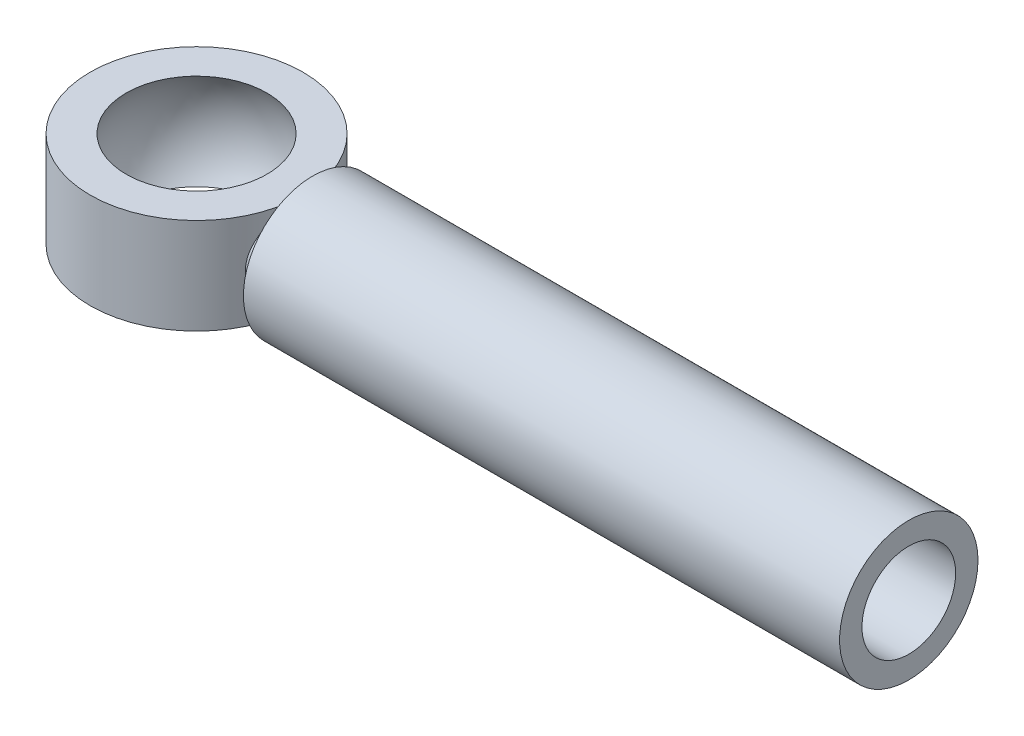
ISO-10303-21;
HEADER;
FILE_DESCRIPTION(('STEP AP214'),'2;1');
FILE_NAME('part.step','',(''),(''),'','','');
FILE_SCHEMA(('AUTOMOTIVE_DESIGN { 1 0 10303 214 1 1 1 1 }'));
ENDSEC;
DATA;
#1=APPLICATION_CONTEXT('core data for automotive mechanical design processes');
#2=APPLICATION_PROTOCOL_DEFINITION('international standard','automotive_design',2000,#1);
#3=PRODUCT_CONTEXT('',#1,'mechanical');
#4=PRODUCT('Part','Part','',(#3));
#5=PRODUCT_RELATED_PRODUCT_CATEGORY('part','',(#4));
#6=PRODUCT_DEFINITION_FORMATION('','',#4);
#7=PRODUCT_DEFINITION_CONTEXT('part definition',#1,'design');
#8=PRODUCT_DEFINITION('design','',#6,#7);
#9=PRODUCT_DEFINITION_SHAPE('','',#8);
#10=(LENGTH_UNIT() NAMED_UNIT(*) SI_UNIT(.MILLI.,.METRE.));
#11=(NAMED_UNIT(*) PLANE_ANGLE_UNIT() SI_UNIT($,.RADIAN.));
#12=(NAMED_UNIT(*) SI_UNIT($,.STERADIAN.) SOLID_ANGLE_UNIT());
#13=UNCERTAINTY_MEASURE_WITH_UNIT(LENGTH_MEASURE(1.E-05),#10,'distance_accuracy_value','');
#14=(GEOMETRIC_REPRESENTATION_CONTEXT(3) GLOBAL_UNCERTAINTY_ASSIGNED_CONTEXT((#13)) GLOBAL_UNIT_ASSIGNED_CONTEXT((#10,
#11,#12)) REPRESENTATION_CONTEXT('',''));
#15=CARTESIAN_POINT('',(0.,0.,0.));
#16=DIRECTION('',(0.,0.,1.));
#17=DIRECTION('',(1.,0.,0.));
#18=AXIS2_PLACEMENT_3D('',#15,#16,#17);
#19=CARTESIAN_POINT('',(-130.,0.,0.));
#20=DIRECTION('',(1.,0.,0.));
#21=DIRECTION('',(0.,0.,-1.));
#22=AXIS2_PLACEMENT_3D('',#19,#20,#21);
#23=PLANE('',#22);
#24=CARTESIAN_POINT('',(-130.,0.,0.));
#25=DIRECTION('',(1.,0.,0.));
#26=DIRECTION('',(0.,0.,-1.));
#27=AXIS2_PLACEMENT_3D('',#24,#25,#26);
#28=CIRCLE('',#27,32.5);
#29=CARTESIAN_POINT('',(-130.,0.,-32.5));
#30=VERTEX_POINT('',#29);
#31=EDGE_CURVE('E12',#30,#30,#28,.T.);
#32=ORIENTED_EDGE('',*,*,#31,.T.);
#33=EDGE_LOOP('',(#32));
#34=FACE_BOUND('',#33,.T.);
#35=CARTESIAN_POINT('',(-130.,0.,0.));
#36=DIRECTION('',(1.,0.,0.));
#37=DIRECTION('',(0.,0.,-1.));
#38=AXIS2_PLACEMENT_3D('',#35,#36,#37);
#39=CIRCLE('',#38,22.);
#40=CARTESIAN_POINT('',(-130.,0.,-22.));
#41=VERTEX_POINT('',#40);
#42=EDGE_CURVE('E53',#41,#41,#39,.T.);
#43=ORIENTED_EDGE('',*,*,#42,.F.);
#44=EDGE_LOOP('',(#43));
#45=FACE_BOUND('',#44,.T.);
#46=ADVANCED_FACE('F46',(#34,#45),#23,.T.);
#47=CARTESIAN_POINT('',(-130.,0.,0.));
#48=DIRECTION('',(-1.,0.,0.));
#49=DIRECTION('',(0.,0.,1.));
#50=AXIS2_PLACEMENT_3D('',#47,#48,#49);
#51=CYLINDRICAL_SURFACE('',#50,32.5);
#52=ORIENTED_EDGE('',*,*,#31,.F.);
#53=EDGE_LOOP('',(#52));
#54=FACE_BOUND('',#53,.T.);
#55=CARTESIAN_POINT('',(-410.,0.,0.));
#56=DIRECTION('',(1.,0.,0.));
#57=DIRECTION('',(0.,0.,-1.));
#58=AXIS2_PLACEMENT_3D('',#55,#56,#57);
#59=CIRCLE('',#58,32.5);
#60=CARTESIAN_POINT('',(-410.,0.,-32.5));
#61=VERTEX_POINT('',#60);
#62=EDGE_CURVE('E57',#61,#61,#59,.T.);
#63=ORIENTED_EDGE('',*,*,#62,.T.);
#64=EDGE_LOOP('',(#63));
#65=FACE_BOUND('',#64,.T.);
#66=ADVANCED_FACE('F48',(#54,#65),#51,.T.);
#67=CARTESIAN_POINT('',(-130.,0.,0.));
#68=DIRECTION('',(-1.,0.,0.));
#69=DIRECTION('',(0.,0.,1.));
#70=AXIS2_PLACEMENT_3D('',#67,#68,#69);
#71=CYLINDRICAL_SURFACE('',#70,22.);
#72=ORIENTED_EDGE('',*,*,#42,.T.);
#73=EDGE_LOOP('',(#72));
#74=FACE_BOUND('',#73,.T.);
#75=CARTESIAN_POINT('',(-410.,0.,0.));
#76=DIRECTION('',(1.,0.,0.));
#77=DIRECTION('',(0.,0.,-1.));
#78=AXIS2_PLACEMENT_3D('',#75,#76,#77);
#79=CIRCLE('',#78,22.);
#80=CARTESIAN_POINT('',(-410.,0.,-22.));
#81=VERTEX_POINT('',#80);
#82=EDGE_CURVE('E61',#81,#81,#79,.T.);
#83=ORIENTED_EDGE('',*,*,#82,.F.);
#84=EDGE_LOOP('',(#83));
#85=FACE_BOUND('',#84,.T.);
#86=ADVANCED_FACE('F70',(#74,#85),#71,.F.);
#87=CARTESIAN_POINT('',(-410.,0.,0.));
#88=DIRECTION('',(1.,0.,0.));
#89=DIRECTION('',(0.,0.,-1.));
#90=AXIS2_PLACEMENT_3D('',#87,#88,#89);
#91=PLANE('',#90);
#92=ORIENTED_EDGE('',*,*,#82,.T.);
#93=EDGE_LOOP('',(#92));
#94=FACE_BOUND('',#93,.T.);
#95=ORIENTED_EDGE('',*,*,#62,.F.);
#96=EDGE_LOOP('',(#95));
#97=FACE_BOUND('',#96,.T.);
#98=ADVANCED_FACE('F67',(#94,#97),#91,.F.);
#99=CLOSED_SHELL('',(#46,#66,#86,#98));
#100=MANIFOLD_SOLID_BREP('B2',#99);
#101=CARTESIAN_POINT('',(-464.5,-22.5,0.));
#102=DIRECTION('',(0.,-1.,0.));
#103=DIRECTION('',(0.,0.,-1.));
#104=AXIS2_PLACEMENT_3D('',#101,#102,#103);
#105=CYLINDRICAL_SURFACE('',#104,50.);
#106=CARTESIAN_POINT('',(-464.5,-22.5,0.));
#107=DIRECTION('',(0.,-1.,0.));
#108=DIRECTION('',(0.,0.,-1.));
#109=AXIS2_PLACEMENT_3D('',#106,#107,#108);
#110=CIRCLE('',#109,50.);
#111=CARTESIAN_POINT('',(-464.5,-22.5,-50.));
#112=VERTEX_POINT('',#111);
#113=EDGE_CURVE('E131',#112,#112,#110,.T.);
#114=ORIENTED_EDGE('',*,*,#113,.F.);
#115=EDGE_LOOP('',(#114));
#116=FACE_BOUND('',#115,.T.);
#117=CARTESIAN_POINT('',(-464.5,22.5,0.));
#118=DIRECTION('',(0.,-1.,0.));
#119=DIRECTION('',(0.,0.,-1.));
#120=AXIS2_PLACEMENT_3D('',#117,#118,#119);
#121=CIRCLE('',#120,50.);
#122=CARTESIAN_POINT('',(-464.5,22.5,-50.));
#123=VERTEX_POINT('',#122);
#124=EDGE_CURVE('E136',#123,#123,#121,.T.);
#125=ORIENTED_EDGE('',*,*,#124,.T.);
#126=EDGE_LOOP('',(#125));
#127=FACE_BOUND('',#126,.T.);
#128=CARTESIAN_POINT('',(-419.600111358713,0.,-22.));
#129=CARTESIAN_POINT('',(-419.600103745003,0.36821249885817,-21.9999835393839));
#130=CARTESIAN_POINT('',(-419.595464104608,0.736402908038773,-21.9906181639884));
#131=CARTESIAN_POINT('',(-419.577236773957,1.47086978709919,-21.9535091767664));
#132=CARTESIAN_POINT('',(-419.563667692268,1.83714864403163,-21.9258037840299));
#133=CARTESIAN_POINT('',(-419.527962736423,2.56607773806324,-21.8524711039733));
#134=CARTESIAN_POINT('',(-419.50585952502,2.92873646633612,-21.806912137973));
#135=CARTESIAN_POINT('',(-419.453408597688,3.64870124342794,-21.6982075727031));
#136=CARTESIAN_POINT('',(-419.423108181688,4.0060259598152,-21.6351628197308));
#137=CARTESIAN_POINT('',(-419.354647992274,4.71482595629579,-21.4919367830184));
#138=CARTESIAN_POINT('',(-419.316522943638,5.06631990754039,-21.4118311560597));
#139=CARTESIAN_POINT('',(-419.23294879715,5.76418120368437,-21.2347100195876));
#140=CARTESIAN_POINT('',(-419.187498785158,6.11054790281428,-21.137692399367));
#141=CARTESIAN_POINT('',(-419.089669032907,6.79819116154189,-20.9266974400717));
#142=CARTESIAN_POINT('',(-419.037269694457,7.13945016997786,-20.8126720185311));
#143=CARTESIAN_POINT('',(-418.925971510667,7.8169339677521,-20.5676832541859));
#144=CARTESIAN_POINT('',(-418.867038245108,8.15312036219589,-20.436629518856));
#145=CARTESIAN_POINT('',(-418.743492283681,8.81847745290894,-20.1585040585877));
#146=CARTESIAN_POINT('',(-418.678869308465,9.14763405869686,-20.0114032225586));
#147=CARTESIAN_POINT('',(-418.54495097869,9.79666794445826,-19.7021554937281));
#148=CARTESIAN_POINT('',(-418.47566907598,10.1165684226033,-19.5400514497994));
#149=CARTESIAN_POINT('',(-418.33312149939,10.746807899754,-19.2010801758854));
#150=CARTESIAN_POINT('',(-418.259862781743,11.0571621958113,-19.0242384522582));
#151=CARTESIAN_POINT('',(-418.110054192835,11.668037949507,-18.6560894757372));
#152=CARTESIAN_POINT('',(-418.033506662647,11.9685661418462,-18.4647924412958));
#153=CARTESIAN_POINT('',(-417.877809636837,12.5595160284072,-18.0680235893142));
#154=CARTESIAN_POINT('',(-417.798659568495,12.8499354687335,-17.8625486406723));
#155=CARTESIAN_POINT('',(-417.638445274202,13.420395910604,-17.4377148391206));
#156=CARTESIAN_POINT('',(-417.557379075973,13.7004253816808,-17.2183412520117));
#157=CARTESIAN_POINT('',(-417.394019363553,14.2498314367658,-16.7659956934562));
#158=CARTESIAN_POINT('',(-417.311723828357,14.5191870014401,-16.5329989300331));
#159=CARTESIAN_POINT('',(-417.146588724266,15.0469804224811,-16.0537033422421));
#160=CARTESIAN_POINT('',(-417.063748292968,15.3053876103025,-15.8073710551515));
#161=CARTESIAN_POINT('',(-416.898590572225,15.8098342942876,-15.3028036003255));
#162=CARTESIAN_POINT('',(-416.816272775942,16.0558882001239,-15.0445830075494));
#163=CARTESIAN_POINT('',(-416.65309878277,16.5343287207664,-14.5173230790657));
#164=CARTESIAN_POINT('',(-416.572238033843,16.76676639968,-14.2483315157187));
#165=CARTESIAN_POINT('',(-416.412489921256,17.2180845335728,-13.6994880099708));
#166=CARTESIAN_POINT('',(-416.333599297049,17.4369884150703,-13.4196562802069));
#167=CARTESIAN_POINT('',(-416.178279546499,17.8614330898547,-12.8491451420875));
#168=CARTESIAN_POINT('',(-416.101851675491,18.0669671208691,-12.5584603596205));
#169=CARTESIAN_POINT('',(-415.951944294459,18.4647515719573,-11.965680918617));
#170=CARTESIAN_POINT('',(-415.878477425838,18.6569471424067,-11.6635462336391));
#171=CARTESIAN_POINT('',(-415.735155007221,19.0273619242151,-11.0485368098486));
#172=CARTESIAN_POINT('',(-415.66531259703,19.2055313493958,-10.7356290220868));
#173=CARTESIAN_POINT('',(-415.530083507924,19.5468398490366,-10.1008179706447));
#174=CARTESIAN_POINT('',(-415.464696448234,19.7099802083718,-9.77891547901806));
#175=CARTESIAN_POINT('',(-415.339187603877,20.0201228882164,-9.12782437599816));
#176=CARTESIAN_POINT('',(-415.279048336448,20.1671792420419,-8.79866492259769));
#177=CARTESIAN_POINT('',(-415.164804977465,20.4445682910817,-8.13313853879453));
#178=CARTESIAN_POINT('',(-415.11068895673,20.5749341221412,-7.7967874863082));
#179=CARTESIAN_POINT('',(-415.008718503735,20.8191808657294,-7.11674244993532));
#180=CARTESIAN_POINT('',(-414.960871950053,20.9330410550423,-6.77303984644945));
#181=CARTESIAN_POINT('',(-414.87170205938,21.1440085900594,-6.07946263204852));
#182=CARTESIAN_POINT('',(-414.830382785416,21.2411055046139,-5.72958432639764));
#183=CARTESIAN_POINT('',(-414.754591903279,21.4182360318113,-5.02480456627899));
#184=CARTESIAN_POINT('',(-414.720120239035,21.4982697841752,-4.66990315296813));
#185=CARTESIAN_POINT('',(-414.658331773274,21.6409749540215,-3.9562334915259));
#186=CARTESIAN_POINT('',(-414.63101063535,21.7036568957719,-3.59746772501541));
#187=CARTESIAN_POINT('',(-414.583838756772,21.8113542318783,-2.87722491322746));
#188=CARTESIAN_POINT('',(-414.563979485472,21.8563898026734,-2.51575144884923));
#189=CARTESIAN_POINT('',(-414.532031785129,21.9285004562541,-1.79125193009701));
#190=CARTESIAN_POINT('',(-414.519931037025,21.9556040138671,-1.42822926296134));
#191=CARTESIAN_POINT('',(-414.503852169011,21.9915252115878,-0.701785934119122));
#192=CARTESIAN_POINT('',(-414.499858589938,22.0003776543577,-0.338367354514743));
#193=CARTESIAN_POINT('',(-414.500154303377,21.999592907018,0.389317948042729));
#194=CARTESIAN_POINT('',(-414.504463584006,21.9899110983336,0.753584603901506));
#195=CARTESIAN_POINT('',(-414.52096819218,21.952496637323,1.48268950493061));
#196=CARTESIAN_POINT('',(-414.533199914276,21.9246806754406,1.84752259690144));
#197=CARTESIAN_POINT('',(-414.565416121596,21.8511506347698,2.57549285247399));
#198=CARTESIAN_POINT('',(-414.585410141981,21.8054145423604,2.9386273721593));
#199=CARTESIAN_POINT('',(-414.63301934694,21.6961077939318,3.66089675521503));
#200=CARTESIAN_POINT('',(-414.660617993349,21.6325758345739,4.02003855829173));
#201=CARTESIAN_POINT('',(-414.723138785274,21.4881374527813,4.73233559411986));
#202=CARTESIAN_POINT('',(-414.758024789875,21.4073167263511,5.08551140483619));
#203=CARTESIAN_POINT('',(-414.834588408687,21.2289066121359,5.78554223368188));
#204=CARTESIAN_POINT('',(-414.876242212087,21.1313759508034,6.13241483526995));
#205=CARTESIAN_POINT('',(-414.966044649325,20.9196150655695,6.81990252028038));
#206=CARTESIAN_POINT('',(-415.014188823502,20.8053963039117,7.16052171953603));
#207=CARTESIAN_POINT('',(-415.116590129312,20.5605540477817,7.83565111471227));
#208=CARTESIAN_POINT('',(-415.170859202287,20.4298984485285,8.17014784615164));
#209=CARTESIAN_POINT('',(-415.285311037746,20.1519494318,8.8331927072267));
#210=CARTESIAN_POINT('',(-415.345522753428,20.0045739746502,9.16170144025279));
#211=CARTESIAN_POINT('',(-415.471232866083,19.6936842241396,9.81160513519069));
#212=CARTESIAN_POINT('',(-415.536751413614,19.5301078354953,10.1329664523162));
#213=CARTESIAN_POINT('',(-415.672188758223,19.188027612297,10.7666951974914));
#214=CARTESIAN_POINT('',(-415.742107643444,19.0095234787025,11.0790624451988));
#215=CARTESIAN_POINT('',(-415.885514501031,18.6385935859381,11.6927911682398));
#216=CARTESIAN_POINT('',(-415.958986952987,18.44622683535,11.9941919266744));
#217=CARTESIAN_POINT('',(-416.108835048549,18.0482539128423,12.5853289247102));
#218=CARTESIAN_POINT('',(-416.185196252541,17.8427107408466,12.8751112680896));
#219=CARTESIAN_POINT('',(-416.340339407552,17.4183568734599,13.443804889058));
#220=CARTESIAN_POINT('',(-416.419119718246,17.1995550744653,13.7227232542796));
#221=CARTESIAN_POINT('',(-416.578606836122,16.7485432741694,14.269719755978));
#222=CARTESIAN_POINT('',(-416.659316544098,16.5163122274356,14.537779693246));
#223=CARTESIAN_POINT('',(-416.822151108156,16.0384241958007,15.0631899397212));
#224=CARTESIAN_POINT('',(-416.904280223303,15.7927188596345,15.3204949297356));
#225=CARTESIAN_POINT('',(-417.069131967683,15.2886644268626,15.8234869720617));
#226=CARTESIAN_POINT('',(-417.151855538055,15.0302869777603,16.0691453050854));
#227=CARTESIAN_POINT('',(-417.316899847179,14.501972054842,16.5475300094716));
#228=CARTESIAN_POINT('',(-417.399220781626,14.2320409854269,16.7802633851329));
#229=CARTESIAN_POINT('',(-417.56272581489,13.6811163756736,17.2324055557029));
#230=CARTESIAN_POINT('',(-417.643910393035,13.4001277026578,17.4518201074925));
#231=CARTESIAN_POINT('',(-417.804404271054,12.8275589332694,17.8769072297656));
#232=CARTESIAN_POINT('',(-417.883714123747,12.5359820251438,18.0825838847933));
#233=CARTESIAN_POINT('',(-418.039721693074,11.9427153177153,18.4797854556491));
#234=CARTESIAN_POINT('',(-418.116419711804,11.6410266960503,18.6713120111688));
#235=CARTESIAN_POINT('',(-418.266466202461,11.0280125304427,19.0398004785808));
#236=CARTESIAN_POINT('',(-418.339814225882,10.7166857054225,19.2167604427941));
#237=CARTESIAN_POINT('',(-418.482426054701,10.0848757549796,19.5557124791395));
#238=CARTESIAN_POINT('',(-418.551687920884,9.76438838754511,19.7176974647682));
#239=CARTESIAN_POINT('',(-418.685385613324,9.11472445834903,20.0262677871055));
#240=CARTESIAN_POINT('',(-418.749816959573,8.78554020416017,20.1728388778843));
#241=CARTESIAN_POINT('',(-418.872931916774,8.12013993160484,20.4497899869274));
#242=CARTESIAN_POINT('',(-418.931626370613,7.78393869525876,20.5802006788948));
#243=CARTESIAN_POINT('',(-419.042559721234,7.10576527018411,20.8242015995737));
#244=CARTESIAN_POINT('',(-419.094820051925,6.76381680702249,20.9378479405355));
#245=CARTESIAN_POINT('',(-419.192426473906,6.07407134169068,21.1482337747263));
#246=CARTESIAN_POINT('',(-419.237777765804,5.72627895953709,21.2449859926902));
#247=CARTESIAN_POINT('',(-419.321182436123,5.02480870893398,21.4216535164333));
#248=CARTESIAN_POINT('',(-419.359220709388,4.67112026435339,21.5015340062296));
#249=CARTESIAN_POINT('',(-419.427346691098,3.95809714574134,21.6439939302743));
#250=CARTESIAN_POINT('',(-419.457403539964,3.59874608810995,21.7065062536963));
#251=CARTESIAN_POINT('',(-419.509161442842,2.87624488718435,21.8137335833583));
#252=CARTESIAN_POINT('',(-419.530849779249,2.51308981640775,21.8584215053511));
#253=CARTESIAN_POINT('',(-419.565628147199,1.78525376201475,21.9298394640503));
#254=CARTESIAN_POINT('',(-419.57873317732,1.42057656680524,21.9566008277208));
#255=CARTESIAN_POINT('',(-419.596118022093,0.691945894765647,21.9919368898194));
#256=CARTESIAN_POINT('',(-419.600441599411,0.327997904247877,22.0006017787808));
#257=CARTESIAN_POINT('',(-419.59975320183,-0.398975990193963,21.9993410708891));
#258=CARTESIAN_POINT('',(-419.594763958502,-0.762001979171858,21.98946074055));
#259=CARTESIAN_POINT('',(-419.575760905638,-1.48760574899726,21.9514754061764));
#260=CARTESIAN_POINT('',(-419.561728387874,-1.85018103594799,21.9233326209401));
#261=CARTESIAN_POINT('',(-419.525156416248,-2.57365096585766,21.8492140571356));
#262=CARTESIAN_POINT('',(-419.502603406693,-2.93454199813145,21.8032098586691));
#263=CARTESIAN_POINT('',(-419.44942654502,-3.65340233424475,21.6937012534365));
#264=CARTESIAN_POINT('',(-419.418795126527,-4.01136857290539,21.6301804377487));
#265=CARTESIAN_POINT('',(-419.349919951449,-4.72313911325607,21.4859851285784));
#266=CARTESIAN_POINT('',(-419.31167509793,-5.0769428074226,21.4053081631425));
#267=CARTESIAN_POINT('',(-419.228018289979,-5.77914194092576,21.2271350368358));
#268=CARTESIAN_POINT('',(-419.182611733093,-6.12754123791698,21.1296515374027));
#269=CARTESIAN_POINT('',(-419.085104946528,-6.81769645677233,20.9182228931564));
#270=CARTESIAN_POINT('',(-419.033016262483,-7.15946269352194,20.8043061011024));
#271=CARTESIAN_POINT('',(-418.922519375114,-7.83506542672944,20.5602810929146));
#272=CARTESIAN_POINT('',(-418.864128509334,-8.16892074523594,20.4302171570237));
#273=CARTESIAN_POINT('',(-418.741474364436,-8.82919214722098,20.1538211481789));
#274=CARTESIAN_POINT('',(-418.677204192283,-9.15559892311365,20.0074699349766));
#275=CARTESIAN_POINT('',(-418.543663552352,-9.80157363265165,19.6988628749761));
#276=CARTESIAN_POINT('',(-418.474372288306,-10.1211050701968,19.5365397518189));
#277=CARTESIAN_POINT('',(-418.331561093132,-10.751979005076,19.1966009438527));
#278=CARTESIAN_POINT('',(-418.258031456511,-11.0633001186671,19.0189496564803));
#279=CARTESIAN_POINT('',(-418.107594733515,-11.676402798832,18.6489838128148));
#280=CARTESIAN_POINT('',(-418.030686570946,-11.9781812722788,18.45666456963));
#281=CARTESIAN_POINT('',(-417.874495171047,-12.5706511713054,18.0584667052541));
#282=CARTESIAN_POINT('',(-417.795219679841,-12.8613729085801,17.8526301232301));
#283=CARTESIAN_POINT('',(-417.635127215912,-13.4312157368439,17.4280846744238));
#284=CARTESIAN_POINT('',(-417.554316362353,-13.7103727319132,17.2094216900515));
#285=CARTESIAN_POINT('',(-417.39171001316,-14.2572125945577,16.7591768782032));
#286=CARTESIAN_POINT('',(-417.309915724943,-14.5249079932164,16.5276098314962));
#287=CARTESIAN_POINT('',(-417.145911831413,-15.0490779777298,16.0516509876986));
#288=CARTESIAN_POINT('',(-417.063701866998,-15.3055398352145,15.8072452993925));
#289=CARTESIAN_POINT('',(-416.899374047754,-15.8074306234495,15.3051806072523));
#290=CARTESIAN_POINT('',(-416.817257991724,-16.0528093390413,15.0474708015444));
#291=CARTESIAN_POINT('',(-416.653876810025,-16.5317660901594,14.519342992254));
#292=CARTESIAN_POINT('',(-416.572615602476,-16.7653004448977,14.2488841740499));
#293=CARTESIAN_POINT('',(-416.411905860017,-17.2193516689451,13.6967128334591));
#294=CARTESIAN_POINT('',(-416.332457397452,-17.4398680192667,13.4149998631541));
#295=CARTESIAN_POINT('',(-416.176362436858,-17.8665039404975,12.8416404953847));
#296=CARTESIAN_POINT('',(-416.099707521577,-18.0726688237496,12.550030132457));
#297=CARTESIAN_POINT('',(-415.949913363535,-18.4701280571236,11.9576008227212));
#298=CARTESIAN_POINT('',(-415.876762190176,-18.6614744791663,11.6568198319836));
#299=CARTESIAN_POINT('',(-415.734298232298,-19.0296646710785,11.0457545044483));
#300=CARTESIAN_POINT('',(-415.664984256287,-19.2065129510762,10.7354731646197));
#301=CARTESIAN_POINT('',(-415.530671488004,-19.5455060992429,10.1051776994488));
#302=CARTESIAN_POINT('',(-415.465682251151,-19.7076186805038,9.7851441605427));
#303=CARTESIAN_POINT('',(-415.340459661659,-20.0170613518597,9.13519118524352));
#304=CARTESIAN_POINT('',(-415.280250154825,-20.1643182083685,8.80523228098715));
#305=CARTESIAN_POINT('',(-415.165449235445,-20.4429492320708,8.13731265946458));
#306=CARTESIAN_POINT('',(-415.110863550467,-20.5743072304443,7.79934420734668));
#307=CARTESIAN_POINT('',(-415.008079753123,-20.8199377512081,7.11776141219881));
#308=CARTESIAN_POINT('',(-414.95985838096,-20.9342726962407,6.77417309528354));
#309=CARTESIAN_POINT('',(-414.870129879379,-21.1457354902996,6.08192285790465));
#310=CARTESIAN_POINT('',(-414.828604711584,-21.242909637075,5.73327742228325));
#311=CARTESIAN_POINT('',(-414.752568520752,-21.419993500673,5.03148989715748));
#312=CARTESIAN_POINT('',(-414.718045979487,-21.4999315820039,4.67835622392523));
#313=CARTESIAN_POINT('',(-414.656356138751,-21.6423881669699,3.96688706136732));
#314=CARTESIAN_POINT('',(-414.62921029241,-21.7048558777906,3.608539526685));
#315=CARTESIAN_POINT('',(-414.582425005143,-21.8122424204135,2.88719534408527));
#316=CARTESIAN_POINT('',(-414.562817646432,-21.857086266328,2.52418547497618));
#317=CARTESIAN_POINT('',(-414.531322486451,-21.9289494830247,1.79587774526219));
#318=CARTESIAN_POINT('',(-414.519438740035,-21.9559594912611,1.4305787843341));
#319=CARTESIAN_POINT('',(-414.503701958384,-21.9916561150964,0.700038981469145));
#320=CARTESIAN_POINT('',(-414.499824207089,-22.0003991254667,0.334801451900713));
#321=CARTESIAN_POINT('',(-414.500193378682,-21.9995609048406,-0.393821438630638));
#322=CARTESIAN_POINT('',(-414.504399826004,-21.9900709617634,-0.757206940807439));
#323=CARTESIAN_POINT('',(-414.520645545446,-21.9532167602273,-1.48193969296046));
#324=CARTESIAN_POINT('',(-414.532664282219,-21.9258993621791,-1.84328978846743));
#325=CARTESIAN_POINT('',(-414.564454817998,-21.8533532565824,-2.56395163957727));
#326=CARTESIAN_POINT('',(-414.584228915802,-21.8081192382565,-2.92326275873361));
#327=CARTESIAN_POINT('',(-414.631351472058,-21.6999421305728,-3.63987978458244));
#328=CARTESIAN_POINT('',(-414.658723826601,-21.6369431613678,-3.99717567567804));
#329=CARTESIAN_POINT('',(-414.72100333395,-21.4930783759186,-4.709213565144));
#330=CARTESIAN_POINT('',(-414.755944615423,-21.4121315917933,-5.06393621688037));
#331=CARTESIAN_POINT('',(-414.832905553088,-21.2327943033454,-5.76891430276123));
#332=CARTESIAN_POINT('',(-414.87493911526,-21.1343695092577,-6.11915947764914));
#333=CARTESIAN_POINT('',(-414.965458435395,-20.920938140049,-6.81316311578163));
#334=CARTESIAN_POINT('',(-415.013935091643,-20.8059549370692,-7.15692996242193));
#335=CARTESIAN_POINT('',(-415.116743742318,-20.5601497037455,-7.8359228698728));
#336=CARTESIAN_POINT('',(-415.171045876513,-20.4294080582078,-8.17118253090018));
#337=CARTESIAN_POINT('',(-415.285284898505,-20.1520500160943,-8.83308930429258));
#338=CARTESIAN_POINT('',(-415.345207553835,-20.0054735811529,-9.1597556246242));
#339=CARTESIAN_POINT('',(-415.470254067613,-19.6965471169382,-9.80539740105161));
#340=CARTESIAN_POINT('',(-415.53538879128,-19.5341639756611,-10.1243548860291));
#341=CARTESIAN_POINT('',(-415.670155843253,-19.1942207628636,-10.7538104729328));
#342=CARTESIAN_POINT('',(-415.739795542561,-19.0166356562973,-11.0642934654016));
#343=CARTESIAN_POINT('',(-415.882881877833,-18.6468894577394,-11.6760264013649));
#344=CARTESIAN_POINT('',(-415.956332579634,-18.4547126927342,-11.9772659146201));
#345=CARTESIAN_POINT('',(-416.106345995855,-18.0563818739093,-12.5697378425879));
#346=CARTESIAN_POINT('',(-416.182909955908,-17.8502222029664,-12.8609661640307));
#347=CARTESIAN_POINT('',(-416.338457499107,-17.4245217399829,-13.432636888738));
#348=CARTESIAN_POINT('',(-416.417440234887,-17.2049856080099,-13.7130829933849));
#349=CARTESIAN_POINT('',(-416.577123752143,-16.7531367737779,-14.2624195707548));
#350=CARTESIAN_POINT('',(-416.657822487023,-16.5208388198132,-14.5313227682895));
#351=CARTESIAN_POINT('',(-416.820265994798,-16.0440386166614,-15.0567631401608));
#352=CARTESIAN_POINT('',(-416.902008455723,-15.79956071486,-15.3133231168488));
#353=CARTESIAN_POINT('',(-417.06604697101,-15.2981962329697,-15.814309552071));
#354=CARTESIAN_POINT('',(-417.14834345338,-15.0412988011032,-16.0587250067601));
#355=CARTESIAN_POINT('',(-417.312849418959,-14.5151088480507,-16.535731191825));
#356=CARTESIAN_POINT('',(-417.395057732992,-14.2457784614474,-16.7682805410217));
#357=CARTESIAN_POINT('',(-417.558548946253,-13.6954912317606,-17.2206835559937));
#358=CARTESIAN_POINT('',(-417.639829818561,-13.4145135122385,-17.4405125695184));
#359=CARTESIAN_POINT('',(-417.800593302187,-12.8416953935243,-17.8665894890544));
#360=CARTESIAN_POINT('',(-417.880074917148,-12.5498492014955,-18.0728299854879));
#361=CARTESIAN_POINT('',(-418.036233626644,-11.9567542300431,-18.4706561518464));
#362=CARTESIAN_POINT('',(-418.112917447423,-11.655531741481,-18.6622783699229));
#363=CARTESIAN_POINT('',(-418.262681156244,-11.0445331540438,-19.0303689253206));
#364=CARTESIAN_POINT('',(-418.335772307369,-10.7347892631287,-19.2068861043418));
#365=CARTESIAN_POINT('',(-418.477783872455,-10.106607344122,-19.5447227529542));
#366=CARTESIAN_POINT('',(-418.546708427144,-9.78817841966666,-19.7060574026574));
#367=CARTESIAN_POINT('',(-418.679872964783,-9.14257558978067,-20.0136518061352));
#368=CARTESIAN_POINT('',(-418.744106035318,-8.81538971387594,-20.1598894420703));
#369=CARTESIAN_POINT('',(-418.867206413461,-8.15199624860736,-20.4370043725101));
#370=CARTESIAN_POINT('',(-418.926051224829,-7.81575780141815,-20.5678178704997));
#371=CARTESIAN_POINT('',(-419.037618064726,-7.13548642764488,-20.813339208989));
#372=CARTESIAN_POINT('',(-419.090324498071,-6.79143619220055,-20.9280061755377));
#373=CARTESIAN_POINT('',(-419.188890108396,-6.09763135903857,-21.1405691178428));
#374=CARTESIAN_POINT('',(-419.234756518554,-5.74788322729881,-21.2384828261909));
#375=CARTESIAN_POINT('',(-419.318820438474,-5.04469598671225,-21.4166470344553));
#376=CARTESIAN_POINT('',(-419.357051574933,-4.69128061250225,-21.4969751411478));
#377=CARTESIAN_POINT('',(-419.425330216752,-3.98158589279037,-21.6397998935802));
#378=CARTESIAN_POINT('',(-419.455410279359,-3.62532397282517,-21.7023675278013));
#379=CARTESIAN_POINT('',(-419.50735303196,-2.90936450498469,-21.8099951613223));
#380=CARTESIAN_POINT('',(-419.529211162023,-2.54966516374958,-21.8550454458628));
#381=CARTESIAN_POINT('',(-419.564412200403,-1.82675934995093,-21.927335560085));
#382=CARTESIAN_POINT('',(-419.577724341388,-1.46354493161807,-21.954511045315));
#383=CARTESIAN_POINT('',(-419.595613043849,-0.73355791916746,-21.9909218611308));
#384=CARTESIAN_POINT('',(-419.600130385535,-0.366777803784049,-22.0000355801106));
#385=CARTESIAN_POINT('',(-419.600111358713,0.,-22.));
#386=B_SPLINE_CURVE_WITH_KNOTS('',3,(#128,#129,#130,#131,#132,#133,#134,#135,#136,#137,#138,
#139,#140,#141,#142,#143,#144,#145,#146,#147,#148,#149,#150,#151,#152,#153,#154,#155,#156,#157,
#158,#159,#160,#161,#162,#163,#164,#165,#166,#167,#168,#169,#170,#171,#172,#173,#174,#175,#176,
#177,#178,#179,#180,#181,#182,#183,#184,#185,#186,#187,#188,#189,#190,#191,#192,#193,#194,#195,
#196,#197,#198,#199,#200,#201,#202,#203,#204,#205,#206,#207,#208,#209,#210,#211,#212,#213,#214,
#215,#216,#217,#218,#219,#220,#221,#222,#223,#224,#225,#226,#227,#228,#229,#230,#231,#232,#233,
#234,#235,#236,#237,#238,#239,#240,#241,#242,#243,#244,#245,#246,#247,#248,#249,#250,#251,#252,
#253,#254,#255,#256,#257,#258,#259,#260,#261,#262,#263,#264,#265,#266,#267,#268,#269,#270,#271,
#272,#273,#274,#275,#276,#277,#278,#279,#280,#281,#282,#283,#284,#285,#286,#287,#288,#289,#290,
#291,#292,#293,#294,#295,#296,#297,#298,#299,#300,#301,#302,#303,#304,#305,#306,#307,#308,#309,
#310,#311,#312,#313,#314,#315,#316,#317,#318,#319,#320,#321,#322,#323,#324,#325,#326,#327,#328,
#329,#330,#331,#332,#333,#334,#335,#336,#337,#338,#339,#340,#341,#342,#343,#344,#345,#346,#347,
#348,#349,#350,#351,#352,#353,#354,#355,#356,#357,#358,#359,#360,#361,#362,#363,#364,#365,#366,
#367,#368,#369,#370,#371,#372,#373,#374,#375,#376,#377,#378,#379,#380,#381,#382,#383,#384,#385),
.UNSPECIFIED.,.F.,.F.,(4,2,2,2,2,2,2,2,2,2,2,2,2,2,2,2,2,2,2,2,2,2,2,2,2,2,2,2,2,2,2,2,2,2,2,2,
2,2,2,2,2,2,2,2,2,2,2,2,2,2,2,2,2,2,2,2,2,2,2,2,2,2,2,2,2,2,2,2,2,2,2,2,2,2,2,2,2,2,2,2,2,2,2,2,
2,2,2,2,2,2,2,2,2,2,2,2,2,2,2,2,2,2,2,2,2,2,2,2,2,2,2,2,2,2,2,2,2,2,2,2,2,2,2,2,2,2,2,2,4),(0.,
1.10445792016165,2.20662145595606,3.30460782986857,4.39638891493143,5.48342569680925,
6.57059824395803,7.66090471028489,8.75725537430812,9.85562908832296,10.9509573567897,
12.0444278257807,13.1371324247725,14.2300791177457,15.3242045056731,16.4203870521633,
17.5194607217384,18.6172210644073,19.7105592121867,20.8019485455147,21.8938856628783,
22.9900752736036,24.0899951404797,25.1898208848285,26.2858303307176,27.3796289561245,
28.4747891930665,29.5706284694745,30.6664587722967,31.7616229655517,32.8555312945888,
33.9476983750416,35.0377808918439,36.1304909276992,37.2282566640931,38.3273751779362,
39.4241219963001,40.5155535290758,41.6032251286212,42.690153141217,43.7792381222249,
44.8739190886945,45.9729713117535,47.0720455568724,48.1666901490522,49.2564434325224,
50.3454734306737,51.4362589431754,52.531253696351,53.6288213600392,54.7257883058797,
55.8222776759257,56.9184395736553,58.0144742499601,59.1106552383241,60.207352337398,
61.3050542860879,62.4006397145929,63.4924705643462,64.5834754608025,65.6767101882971,
66.7741122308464,67.8731754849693,68.9703130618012,70.06196946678,71.1509647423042,
72.2422201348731,73.3352190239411,74.429245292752,75.5234293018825,76.6167925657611,
77.7082914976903,78.7968607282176,79.8867229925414,80.9813902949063,82.0786723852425,
83.1763065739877,84.2706754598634,85.3613436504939,86.4507872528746,87.54143492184,
88.6366097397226,89.7355667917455,90.8345676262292,91.9299243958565,93.0212387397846,
94.1122122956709,95.2055213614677,96.3039806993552,97.4035479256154,98.4989781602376,
99.5914063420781,100.682022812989,101.775777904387,102.874137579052,103.973073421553,
105.068611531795,106.15867884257,107.245892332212,108.333428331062,109.424424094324,
110.520445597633,111.618641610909,112.715302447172,113.806588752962,114.895182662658,
115.986108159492,117.078866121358,118.172814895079,119.267205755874,120.361217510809,
121.453990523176,122.544660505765,123.636301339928,124.731520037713,125.828794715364,
126.926662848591,128.021689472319,129.113029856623,130.203267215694,131.295079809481,
132.391260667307,133.490168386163,134.587905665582,135.680696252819,136.76905539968,
137.858017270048,138.950877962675,140.051072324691),.UNSPECIFIED.);
#387=CARTESIAN_POINT('',(-419.600111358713,0.,-22.));
#388=VERTEX_POINT('',#387);
#389=EDGE_CURVE('E45',#388,#388,#386,.T.);
#390=ORIENTED_EDGE('',*,*,#389,.F.);
#391=EDGE_LOOP('',(#390));
#392=FACE_BOUND('',#391,.T.);
#393=ADVANCED_FACE('F116',(#116,#127,#392),#105,.T.);
#394=CARTESIAN_POINT('',(-464.5,0.,0.));
#395=DIRECTION('',(0.,-1.,0.));
#396=DIRECTION('',(-1.,0.,0.));
#397=AXIS2_PLACEMENT_3D('',#394,#395,#396);
#398=SPHERICAL_SURFACE('',#397,40.0000000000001);
#399=CARTESIAN_POINT('',(-464.5,22.5,0.));
#400=DIRECTION('',(0.,-1.,0.));
#401=DIRECTION('',(0.,0.,-1.));
#402=AXIS2_PLACEMENT_3D('',#399,#400,#401);
#403=CIRCLE('',#402,33.0718913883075);
#404=CARTESIAN_POINT('',(-497.571891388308,22.5,0.));
#405=VERTEX_POINT('',#404);
#406=EDGE_CURVE('E171',#405,#405,#403,.T.);
#407=CARTESIAN_POINT('',(-464.5,-22.5,0.));
#408=DIRECTION('',(0.,-1.,0.));
#409=DIRECTION('',(0.,0.,-1.));
#410=AXIS2_PLACEMENT_3D('',#407,#408,#409);
#411=CIRCLE('',#410,33.0718913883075);
#412=CARTESIAN_POINT('',(-497.571891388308,-22.5,0.));
#413=VERTEX_POINT('',#412);
#414=EDGE_CURVE('E126',#413,#413,#411,.T.);
#415=CARTESIAN_POINT('',(-497.571891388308,22.5,0.));
#416=CARTESIAN_POINT('',(-497.851929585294,22.0883908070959,0.));
#417=CARTESIAN_POINT('',(-498.124275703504,21.671548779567,0.));
#418=CARTESIAN_POINT('',(-498.65322145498,20.827990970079,0.));
#419=CARTESIAN_POINT('',(-498.909821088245,20.4012751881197,0.));
#420=CARTESIAN_POINT('',(-499.406911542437,19.5385617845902,0.));
#421=CARTESIAN_POINT('',(-499.647402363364,19.1025641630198,0.));
#422=CARTESIAN_POINT('',(-500.11194120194,18.2218956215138,0.));
#423=CARTESIAN_POINT('',(-500.33598921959,17.7772247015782,0.));
#424=CARTESIAN_POINT('',(-500.767329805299,16.8798292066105,0.));
#425=CARTESIAN_POINT('',(-500.974622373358,16.4271046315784,0.));
#426=CARTESIAN_POINT('',(-501.372163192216,15.5142329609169,0.));
#427=CARTESIAN_POINT('',(-501.562411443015,15.0540858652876,0.));
#428=CARTESIAN_POINT('',(-501.925598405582,14.1270105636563,0.));
#429=CARTESIAN_POINT('',(-502.098537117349,13.6600823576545,0.));
#430=CARTESIAN_POINT('',(-502.426863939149,12.7200957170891,0.));
#431=CARTESIAN_POINT('',(-502.582252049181,12.2470372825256,0.));
#432=CARTESIAN_POINT('',(-502.875261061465,11.2954496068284,0.));
#433=CARTESIAN_POINT('',(-503.012881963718,10.8169203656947,0.));
#434=CARTESIAN_POINT('',(-503.270164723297,9.85505812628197,0.));
#435=CARTESIAN_POINT('',(-503.389826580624,9.37172512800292,0.));
#436=CARTESIAN_POINT('',(-503.611024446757,8.40092911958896,0.));
#437=CARTESIAN_POINT('',(-503.712560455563,7.91346610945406,0.));
#438=CARTESIAN_POINT('',(-503.897365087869,6.93508957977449,0.));
#439=CARTESIAN_POINT('',(-503.980633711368,6.44417606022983,0.));
#440=CARTESIAN_POINT('',(-504.128787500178,5.4595828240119,0.));
#441=CARTESIAN_POINT('',(-504.19367266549,4.96590310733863,0.));
#442=CARTESIAN_POINT('',(-504.304969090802,3.9764656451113,0.));
#443=CARTESIAN_POINT('',(-504.351380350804,3.48070789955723,0.));
#444=CARTESIAN_POINT('',(-504.425664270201,2.48780544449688,0.));
#445=CARTESIAN_POINT('',(-504.453536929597,1.99066073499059,0.));
#446=CARTESIAN_POINT('',(-504.490704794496,0.995677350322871,0.));
#447=CARTESIAN_POINT('',(-504.5,0.497838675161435,0.));
#448=CARTESIAN_POINT('',(-504.5,-0.497838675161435,0.));
#449=CARTESIAN_POINT('',(-504.490704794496,-0.995677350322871,0.));
#450=CARTESIAN_POINT('',(-504.453536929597,-1.99066073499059,0.));
#451=CARTESIAN_POINT('',(-504.425664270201,-2.48780544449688,0.));
#452=CARTESIAN_POINT('',(-504.351380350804,-3.48070789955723,0.));
#453=CARTESIAN_POINT('',(-504.304969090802,-3.9764656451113,0.));
#454=CARTESIAN_POINT('',(-504.19367266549,-4.96590310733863,0.));
#455=CARTESIAN_POINT('',(-504.128787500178,-5.4595828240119,0.));
#456=CARTESIAN_POINT('',(-503.980633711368,-6.44417606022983,0.));
#457=CARTESIAN_POINT('',(-503.897365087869,-6.93508957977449,0.));
#458=CARTESIAN_POINT('',(-503.712560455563,-7.91346610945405,0.));
#459=CARTESIAN_POINT('',(-503.611024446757,-8.40092911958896,0.));
#460=CARTESIAN_POINT('',(-503.389826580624,-9.37172512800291,0.));
#461=CARTESIAN_POINT('',(-503.270164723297,-9.85505812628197,0.));
#462=CARTESIAN_POINT('',(-503.012881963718,-10.8169203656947,0.));
#463=CARTESIAN_POINT('',(-502.875261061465,-11.2954496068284,0.));
#464=CARTESIAN_POINT('',(-502.582252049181,-12.2470372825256,0.));
#465=CARTESIAN_POINT('',(-502.426863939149,-12.7200957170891,0.));
#466=CARTESIAN_POINT('',(-502.098537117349,-13.6600823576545,0.));
#467=CARTESIAN_POINT('',(-501.925598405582,-14.1270105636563,0.));
#468=CARTESIAN_POINT('',(-501.562411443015,-15.0540858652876,0.));
#469=CARTESIAN_POINT('',(-501.372163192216,-15.5142329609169,0.));
#470=CARTESIAN_POINT('',(-500.974622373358,-16.4271046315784,0.));
#471=CARTESIAN_POINT('',(-500.767329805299,-16.8798292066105,0.));
#472=CARTESIAN_POINT('',(-500.33598921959,-17.7772247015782,0.));
#473=CARTESIAN_POINT('',(-500.11194120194,-18.2218956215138,0.));
#474=CARTESIAN_POINT('',(-499.647402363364,-19.1025641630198,0.));
#475=CARTESIAN_POINT('',(-499.406911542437,-19.5385617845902,0.));
#476=CARTESIAN_POINT('',(-498.909821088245,-20.4012751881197,0.));
#477=CARTESIAN_POINT('',(-498.65322145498,-20.827990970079,0.));
#478=CARTESIAN_POINT('',(-498.124275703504,-21.671548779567,0.));
#479=CARTESIAN_POINT('',(-497.851929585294,-22.0883908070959,0.));
#480=CARTESIAN_POINT('',(-497.571891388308,-22.5,0.));
#481=B_SPLINE_CURVE_WITH_KNOTS('',3,(#415,#416,#417,#418,#419,#420,#421,#422,#423,#424,#425,
#426,#427,#428,#429,#430,#431,#432,#433,#434,#435,#436,#437,#438,#439,#440,#441,#442,#443,#444,
#445,#446,#447,#448,#449,#450,#451,#452,#453,#454,#455,#456,#457,#458,#459,#460,#461,#462,#463,
#464,#465,#466,#467,#468,#469,#470,#471,#472,#473,#474,#475,#476,#477,#478,#479,#480),
.UNSPECIFIED.,.F.,.F.,(4,2,2,2,2,2,2,2,2,2,2,2,2,2,2,2,2,2,2,2,2,2,2,2,2,2,2,2,2,2,2,2,4),(0.,
1.49342928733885,2.98685857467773,4.48028786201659,5.97371714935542,7.4671464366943,
8.96057572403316,10.454005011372,11.9474342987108,13.4408635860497,14.9342928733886,
16.4277221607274,17.9211514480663,19.4145807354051,20.908010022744,22.4014393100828,
23.8948685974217,25.3882978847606,26.8817271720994,28.3751564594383,29.8685857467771,
31.362015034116,32.8554443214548,34.3488736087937,35.8423028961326,37.3357321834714,
38.8291614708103,40.3225907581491,41.816020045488,43.3094493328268,44.8028786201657,
46.2963079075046,47.7897371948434),.UNSPECIFIED.);
#482=EDGE_CURVE('BSEAM118',#405,#413,#481,.T.);
#483=ORIENTED_EDGE('',*,*,#406,.F.);
#484=ORIENTED_EDGE('',*,*,#414,.T.);
#485=ORIENTED_EDGE('',*,*,#482,.T.);
#486=ORIENTED_EDGE('',*,*,#482,.F.);
#487=EDGE_LOOP('',(#483,#485,#484,#486));
#488=FACE_BOUND('',#487,.T.);
#489=ADVANCED_FACE('F118',(#488),#398,.F.);
#490=CARTESIAN_POINT('',(-514.5,-22.5,0.));
#491=DIRECTION('',(0.,1.,0.));
#492=DIRECTION('',(0.,0.,1.));
#493=AXIS2_PLACEMENT_3D('',#490,#491,#492);
#494=PLANE('',#493);
#495=ORIENTED_EDGE('',*,*,#414,.F.);
#496=EDGE_LOOP('',(#495));
#497=FACE_BOUND('',#496,.T.);
#498=ORIENTED_EDGE('',*,*,#113,.T.);
#499=EDGE_LOOP('',(#498));
#500=FACE_BOUND('',#499,.T.);
#501=ADVANCED_FACE('F145',(#497,#500),#494,.F.);
#502=CARTESIAN_POINT('',(-497.571891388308,22.5,0.));
#503=DIRECTION('',(0.,-1.,0.));
#504=DIRECTION('',(0.,0.,-1.));
#505=AXIS2_PLACEMENT_3D('',#502,#503,#504);
#506=PLANE('',#505);
#507=ORIENTED_EDGE('',*,*,#124,.F.);
#508=EDGE_LOOP('',(#507));
#509=FACE_BOUND('',#508,.T.);
#510=ORIENTED_EDGE('',*,*,#406,.T.);
#511=EDGE_LOOP('',(#510));
#512=FACE_BOUND('',#511,.T.);
#513=ADVANCED_FACE('F151',(#509,#512),#506,.F.);
#514=CARTESIAN_POINT('',(-419.600111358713,0.,-22.));
#515=CARTESIAN_POINT('',(-419.600111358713,-1.47356863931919,-22.));
#516=CARTESIAN_POINT('',(-419.527512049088,-2.91814901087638,-21.8534915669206));
#517=CARTESIAN_POINT('',(-419.255008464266,-5.75327560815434,-21.2835736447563));
#518=CARTESIAN_POINT('',(-419.051749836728,-7.15829904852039,-20.8524434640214));
#519=CARTESIAN_POINT('',(-418.559316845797,-9.81041135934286,-19.7438970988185));
#520=CARTESIAN_POINT('',(-418.270924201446,-11.0652697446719,-19.06841876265));
#521=CARTESIAN_POINT('',(-417.645586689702,-13.440565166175,-17.4755828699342));
#522=CARTESIAN_POINT('',(-417.311602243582,-14.5478466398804,-16.5639017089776));
#523=CARTESIAN_POINT('',(-416.328769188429,-17.551276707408,-13.5633112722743));
#524=CARTESIAN_POINT('',(-415.684019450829,-19.1837740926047,-11.1437842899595));
#525=CARTESIAN_POINT('',(-415.000344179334,-20.8439495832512,-7.18192487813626));
#526=CARTESIAN_POINT('',(-414.814260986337,-21.277683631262,-5.77684540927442));
#527=CARTESIAN_POINT('',(-414.565323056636,-21.8526685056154,-2.92790757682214));
#528=CARTESIAN_POINT('',(-414.500895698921,-21.9979643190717,-1.48733903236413));
#529=CARTESIAN_POINT('',(-414.499122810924,-22.0019936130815,1.42649522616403));
#530=CARTESIAN_POINT('',(-414.563990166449,-21.8556834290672,2.90294007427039));
#531=CARTESIAN_POINT('',(-414.810500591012,-21.2864316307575,5.74332548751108));
#532=CARTESIAN_POINT('',(-414.992611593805,-20.8624258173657,7.13201143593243));
#533=CARTESIAN_POINT('',(-415.453145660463,-19.744701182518,9.81087016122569));
#534=CARTESIAN_POINT('',(-415.725403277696,-19.0657311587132,11.0693266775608));
#535=CARTESIAN_POINT('',(-416.32394068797,-17.4778004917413,13.4372090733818));
#536=CARTESIAN_POINT('',(-416.653298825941,-16.55914649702,14.5536013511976));
#537=CARTESIAN_POINT('',(-417.310117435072,-14.5527844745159,16.5598644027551));
#538=CARTESIAN_POINT('',(-417.639735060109,-13.4607978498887,17.4599291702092));
#539=CARTESIAN_POINT('',(-418.265214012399,-11.0889171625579,19.0546089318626));
#540=CARTESIAN_POINT('',(-418.55782018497,-9.8162855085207,19.7403292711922));
#541=CARTESIAN_POINT('',(-419.292873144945,-5.86401045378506,21.3956450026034));
#542=CARTESIAN_POINT('',(-419.597775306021,-2.93700034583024,21.9952323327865));
#543=CARTESIAN_POINT('',(-419.601257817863,1.41460124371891,22.002339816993));
#544=CARTESIAN_POINT('',(-419.529648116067,2.88922118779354,21.8578919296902));
#545=CARTESIAN_POINT('',(-419.256789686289,5.74135262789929,21.2873650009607));
#546=CARTESIAN_POINT('',(-419.058037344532,7.11954827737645,20.8661579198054));
#547=CARTESIAN_POINT('',(-418.318226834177,11.1184604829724,19.2020283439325));
#548=CARTESIAN_POINT('',(-417.647018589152,13.5219212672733,17.5867802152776));
#549=CARTESIAN_POINT('',(-416.656404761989,16.5505204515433,14.5641536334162));
#550=CARTESIAN_POINT('',(-416.333496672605,17.4515009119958,13.4711436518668));
#551=CARTESIAN_POINT('',(-415.734660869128,19.0420886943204,11.1097008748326));
#552=CARTESIAN_POINT('',(-415.456585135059,19.7360715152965,9.82609185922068));
#553=CARTESIAN_POINT('',(-414.999291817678,20.8464886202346,7.1755496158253));
#554=CARTESIAN_POINT('',(-414.81716734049,21.2709157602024,5.80189598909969));
#555=CARTESIAN_POINT('',(-414.566741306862,21.8494466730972,2.95220839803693));
#556=CARTESIAN_POINT('',(-414.500733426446,21.998333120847,1.47718467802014));
#557=CARTESIAN_POINT('',(-414.498551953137,22.0032910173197,-2.87925738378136));
#558=CARTESIAN_POINT('',(-414.765400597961,21.4137599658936,-5.80845936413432));
#559=CARTESIAN_POINT('',(-415.450103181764,19.7521407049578,-9.79411897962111));
#560=CARTESIAN_POINT('',(-415.72744636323,19.0605448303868,-11.078369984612));
#561=CARTESIAN_POINT('',(-416.326640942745,17.4704007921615,-13.4469233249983));
#562=CARTESIAN_POINT('',(-416.650085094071,16.5688590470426,-14.5436555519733));
#563=CARTESIAN_POINT('',(-417.643190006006,13.5355671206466,-17.577498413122));
#564=CARTESIAN_POINT('',(-418.309773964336,11.1540371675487,-19.1821043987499));
#565=CARTESIAN_POINT('',(-419.053096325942,7.15121979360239,-20.8554902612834));
#566=CARTESIAN_POINT('',(-419.251939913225,5.77688274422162,-21.2770714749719));
#567=CARTESIAN_POINT('',(-419.525667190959,2.94551256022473,-21.8497162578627));
#568=CARTESIAN_POINT('',(-419.600111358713,1.47356863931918,-22.));
#569=CARTESIAN_POINT('',(-419.600111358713,0.,-22.));
#570=B_SPLINE_CURVE_WITH_KNOTS('',3,(#514,#515,#516,#517,#518,#519,#520,#521,#522,#523,#524,
#525,#526,#527,#528,#529,#530,#531,#532,#533,#534,#535,#536,#537,#538,#539,#540,#541,#542,#543,
#544,#545,#546,#547,#548,#549,#550,#551,#552,#553,#554,#555,#556,#557,#558,#559,#560,#561,#562,
#563,#564,#565,#566,#567,#568,#569),.UNSPECIFIED.,.T.,.F.,(4,2,2,2,2,2,2,2,2,2,2,2,2,2,2,2,2,2,
2,2,2,2,2,2,2,2,2,4),(0.,0.0312500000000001,0.0625000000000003,0.0937500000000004,
0.125000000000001,0.187500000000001,0.218750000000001,0.250000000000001,0.281250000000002,
0.312500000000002,0.343750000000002,0.375000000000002,0.406250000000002,0.437500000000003,
0.500000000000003,0.531250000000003,0.562500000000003,0.625000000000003,0.656250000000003,
0.687500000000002,0.718750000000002,0.750000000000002,0.812500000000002,0.843750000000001,
0.875000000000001,0.9375,0.96875,1.),.UNSPECIFIED.);
#571=DIRECTION('',(1.,0.,0.));
#572=VECTOR('',#571,1.);
#573=SURFACE_OF_LINEAR_EXTRUSION('',#570,#572);
#574=ORIENTED_EDGE('',*,*,#389,.T.);
#575=EDGE_LOOP('',(#574));
#576=FACE_BOUND('',#575,.T.);
#577=CARTESIAN_POINT('',(-400.,0.,-22.));
#578=CARTESIAN_POINT('',(-400.,0.30931780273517,-21.9999641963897));
#579=CARTESIAN_POINT('',(-400.,0.618649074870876,-21.99337137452));
#580=CARTESIAN_POINT('',(-400.,1.2367729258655,-21.9671202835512));
#581=CARTESIAN_POINT('',(-400.,1.54556545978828,-21.9474609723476));
#582=CARTESIAN_POINT('',(-400.,2.16212643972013,-21.8952412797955));
#583=CARTESIAN_POINT('',(-400.,2.46989463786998,-21.8626779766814));
#584=CARTESIAN_POINT('',(-400.,3.08379869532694,-21.7846830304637));
#585=CARTESIAN_POINT('',(-400.,3.38993459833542,-21.7392517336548));
#586=CARTESIAN_POINT('',(-400.,3.84765109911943,-21.66140215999));
#587=CARTESIAN_POINT('',(-400.,4.00006709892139,-21.6338155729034));
#588=CARTESIAN_POINT('',(-400.,4.30427423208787,-21.5753885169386));
#589=CARTESIAN_POINT('',(-400.,4.45606536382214,-21.5445480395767));
#590=CARTESIAN_POINT('',(-400.,4.91041970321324,-21.4472682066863));
#591=CARTESIAN_POINT('',(-400.,5.21197817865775,-21.3760680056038));
#592=CARTESIAN_POINT('',(-400.,5.81178408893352,-21.2209646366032));
#593=CARTESIAN_POINT('',(-400.,6.11003170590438,-21.1370621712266));
#594=CARTESIAN_POINT('',(-400.,6.70269582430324,-20.9566712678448));
#595=CARTESIAN_POINT('',(-400.,6.99711236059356,-20.8601829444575));
#596=CARTESIAN_POINT('',(-400.,7.58143970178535,-20.6548687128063));
#597=CARTESIAN_POINT('',(-400.,7.87135274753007,-20.5460491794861));
#598=CARTESIAN_POINT('',(-400.,8.44636576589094,-20.3163589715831));
#599=CARTESIAN_POINT('',(-400.,8.73146567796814,-20.1954881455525));
#600=CARTESIAN_POINT('',(-400.,9.29638052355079,-19.9419507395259));
#601=CARTESIAN_POINT('',(-400.,9.57619542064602,-19.8092840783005));
#602=CARTESIAN_POINT('',(-400.,10.1299666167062,-19.5322867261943));
#603=CARTESIAN_POINT('',(-400.,10.4039229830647,-19.3879561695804));
#604=CARTESIAN_POINT('',(-400.,11.2160982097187,-18.9378246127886));
#605=CARTESIAN_POINT('',(-400.,11.7448816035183,-18.6147678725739));
#606=CARTESIAN_POINT('',(-400.,12.7730602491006,-17.9248544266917));
#607=CARTESIAN_POINT('',(-400.,13.2724554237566,-17.5579976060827));
#608=CARTESIAN_POINT('',(-400.,13.996364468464,-16.9774863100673));
#609=CARTESIAN_POINT('',(-400.,14.2332839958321,-16.7791219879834));
#610=CARTESIAN_POINT('',(-400.,14.6985896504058,-16.3725933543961));
#611=CARTESIAN_POINT('',(-400.,14.9269756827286,-16.1644289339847));
#612=CARTESIAN_POINT('',(-400.,15.3748718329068,-15.738775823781));
#613=CARTESIAN_POINT('',(-400.,15.5943820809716,-15.5212872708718));
#614=CARTESIAN_POINT('',(-400.,16.0241197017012,-15.0773258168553));
#615=CARTESIAN_POINT('',(-400.,16.2343471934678,-14.8508530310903));
#616=CARTESIAN_POINT('',(-400.,16.6450406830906,-14.3892176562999));
#617=CARTESIAN_POINT('',(-400.,16.8455066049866,-14.1540549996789));
#618=CARTESIAN_POINT('',(-400.,17.2362967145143,-13.6754483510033));
#619=CARTESIAN_POINT('',(-400.,17.4266208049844,-13.4320042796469));
#620=CARTESIAN_POINT('',(-400.,17.7968312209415,-12.9372794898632));
#621=CARTESIAN_POINT('',(-400.,17.9767171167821,-12.6859984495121));
#622=CARTESIAN_POINT('',(-400.,18.2385464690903,-12.3036245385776));
#623=CARTESIAN_POINT('',(-400.,18.3244915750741,-12.1752547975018));
#624=CARTESIAN_POINT('',(-400.,18.4936100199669,-11.9167023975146));
#625=CARTESIAN_POINT('',(-400.,18.5767833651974,-11.7865197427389));
#626=CARTESIAN_POINT('',(-400.,18.8223953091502,-11.3929963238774));
#627=CARTESIAN_POINT('',(-400.,18.9806762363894,-11.1270447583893));
#628=CARTESIAN_POINT('',(-400.,19.2859861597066,-10.5887662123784));
#629=CARTESIAN_POINT('',(-400.,19.4330149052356,-10.3164390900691));
#630=CARTESIAN_POINT('',(-400.,19.715560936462,-9.76589491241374));
#631=CARTESIAN_POINT('',(-400.,19.8510791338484,-9.48767832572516));
#632=CARTESIAN_POINT('',(-400.,20.1102539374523,-8.92580248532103));
#633=CARTESIAN_POINT('',(-400.,20.2339108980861,-8.64214339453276));
#634=CARTESIAN_POINT('',(-400.,20.5862746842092,-7.7834890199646));
#635=CARTESIAN_POINT('',(-400.,20.7964116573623,-7.20074438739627));
#636=CARTESIAN_POINT('',(-400.,21.1669541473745,-6.0197303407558));
#637=CARTESIAN_POINT('',(-400.,21.327353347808,-5.42145896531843));
#638=CARTESIAN_POINT('',(-400.,21.5979214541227,-4.21397763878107));
#639=CARTESIAN_POINT('',(-400.,21.7081238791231,-3.60477527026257));
#640=CARTESIAN_POINT('',(-400.,21.8351008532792,-2.68587852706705));
#641=CARTESIAN_POINT('',(-400.,21.8710395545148,-2.3787155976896));
#642=CARTESIAN_POINT('',(-400.,21.9299770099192,-1.76313218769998));
#643=CARTESIAN_POINT('',(-400.,21.9529759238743,-1.45471172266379));
#644=CARTESIAN_POINT('',(-400.,21.9858411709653,-0.837186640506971));
#645=CARTESIAN_POINT('',(-400.,21.9957080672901,-0.528082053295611));
#646=CARTESIAN_POINT('',(-400.,22.0020346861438,0.0902663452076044));
#647=CARTESIAN_POINT('',(-400.,21.9984943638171,0.399510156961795));
#648=CARTESIAN_POINT('',(-400.,21.9783198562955,1.01759085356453));
#649=CARTESIAN_POINT('',(-400.,21.9616846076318,1.32642770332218));
#650=CARTESIAN_POINT('',(-400.,21.915549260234,1.94313869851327));
#651=CARTESIAN_POINT('',(-400.,21.8860490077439,2.25101283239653));
#652=CARTESIAN_POINT('',(-400.,21.814180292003,2.86583267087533));
#653=CARTESIAN_POINT('',(-400.,21.771788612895,3.17277568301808));
#654=CARTESIAN_POINT('',(-400.,21.6985268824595,3.63162340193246));
#655=CARTESIAN_POINT('',(-400.,21.6724933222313,3.78431453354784));
#656=CARTESIAN_POINT('',(-400.,21.6171573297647,4.08910661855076));
#657=CARTESIAN_POINT('',(-400.,21.5878548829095,4.24120756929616));
#658=CARTESIAN_POINT('',(-400.,21.5260301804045,4.5447428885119));
#659=CARTESIAN_POINT('',(-400.,21.4935081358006,4.69617729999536));
#660=CARTESIAN_POINT('',(-400.,21.425300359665,4.99832691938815));
#661=CARTESIAN_POINT('',(-400.,21.3896146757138,5.14904213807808));
#662=CARTESIAN_POINT('',(-400.,21.2777872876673,5.6000088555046));
#663=CARTESIAN_POINT('',(-400.,21.1968728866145,5.89909301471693));
#664=CARTESIAN_POINT('',(-400.,21.0224197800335,6.49356645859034));
#665=CARTESIAN_POINT('',(-400.,20.9288801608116,6.78895547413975));
#666=CARTESIAN_POINT('',(-400.,20.7293481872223,7.37551305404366));
#667=CARTESIAN_POINT('',(-400.,20.6233557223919,7.66668158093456));
#668=CARTESIAN_POINT('',(-400.,20.4552530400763,8.09988846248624));
#669=CARTESIAN_POINT('',(-400.,20.3976955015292,8.24370963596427));
#670=CARTESIAN_POINT('',(-400.,20.2795700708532,8.53009904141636));
#671=CARTESIAN_POINT('',(-400.,20.2190023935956,8.67266736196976));
#672=CARTESIAN_POINT('',(-400.,20.0327235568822,9.09837944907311));
#673=CARTESIAN_POINT('',(-400.,19.9024348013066,9.37953496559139));
#674=CARTESIAN_POINT('',(-400.,19.6306827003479,9.9351423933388));
#675=CARTESIAN_POINT('',(-400.,19.489260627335,10.2096145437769));
#676=CARTESIAN_POINT('',(-400.,19.1951300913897,10.7524426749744));
#677=CARTESIAN_POINT('',(-400.,19.0424216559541,11.0207986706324));
#678=CARTESIAN_POINT('',(-400.,18.7259225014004,11.55089697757));
#679=CARTESIAN_POINT('',(-400.,18.5621321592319,11.81263951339));
#680=CARTESIAN_POINT('',(-400.,18.3081616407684,12.1997896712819));
#681=CARTESIAN_POINT('',(-400.,18.2221230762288,12.3279303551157));
#682=CARTESIAN_POINT('',(-400.,18.047384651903,12.5823967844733));
#683=CARTESIAN_POINT('',(-400.,17.9586846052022,12.7087224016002));
#684=CARTESIAN_POINT('',(-400.,17.6886457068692,13.0848440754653));
#685=CARTESIAN_POINT('',(-400.,17.503347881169,13.3318157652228));
#686=CARTESIAN_POINT('',(-400.,17.1224818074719,13.8176936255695));
#687=CARTESIAN_POINT('',(-400.,16.9269136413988,14.0565998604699));
#688=CARTESIAN_POINT('',(-400.,16.5258316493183,14.5259270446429));
#689=CARTESIAN_POINT('',(-400.,16.3203175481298,14.7563477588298));
#690=CARTESIAN_POINT('',(-400.,15.8997978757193,15.2083566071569));
#691=CARTESIAN_POINT('',(-400.,15.6847922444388,15.429944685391));
#692=CARTESIAN_POINT('',(-400.,15.2450024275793,15.8645887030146));
#693=CARTESIAN_POINT('',(-400.,15.0201901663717,16.0776162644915));
#694=CARTESIAN_POINT('',(-400.,14.5617869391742,16.4939719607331));
#695=CARTESIAN_POINT('',(-400.,14.3281960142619,16.6973001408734));
#696=CARTESIAN_POINT('',(-400.,13.6148752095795,17.2922005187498));
#697=CARTESIAN_POINT('',(-400.,13.1224923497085,17.6687922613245));
#698=CARTESIAN_POINT('',(-400.,12.10776818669,18.3790436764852));
#699=CARTESIAN_POINT('',(-400.,11.5854253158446,18.7127010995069));
#700=CARTESIAN_POINT('',(-400.,10.5143410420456,19.3348072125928));
#701=CARTESIAN_POINT('',(-400.,9.96559908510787,19.6232549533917));
#702=CARTESIAN_POINT('',(-400.,9.12622875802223,20.0201890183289));
#703=CARTESIAN_POINT('',(-400.,8.84388637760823,20.1464853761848));
#704=CARTESIAN_POINT('',(-400.,8.2741306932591,20.3871247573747));
#705=CARTESIAN_POINT('',(-400.,7.98671739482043,20.5014677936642));
#706=CARTESIAN_POINT('',(-400.,7.4073487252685,20.7179586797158));
#707=CARTESIAN_POINT('',(-400.,7.11539350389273,20.820106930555));
#708=CARTESIAN_POINT('',(-400.,6.52741457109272,21.0119341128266));
#709=CARTESIAN_POINT('',(-400.,6.23139085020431,21.1016130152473));
#710=CARTESIAN_POINT('',(-400.,5.6358301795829,21.2683469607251));
#711=CARTESIAN_POINT('',(-400.,5.33629356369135,21.3454031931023));
#712=CARTESIAN_POINT('',(-400.,4.88477492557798,21.4514676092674));
#713=CARTESIAN_POINT('',(-400.,4.73389617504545,21.4852364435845));
#714=CARTESIAN_POINT('',(-400.,4.43146731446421,21.54961996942));
#715=CARTESIAN_POINT('',(-400.,4.2799172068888,21.5802346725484));
#716=CARTESIAN_POINT('',(-400.,3.82432063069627,21.6671918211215));
#717=CARTESIAN_POINT('',(-400.,3.5193273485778,21.7186474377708));
#718=CARTESIAN_POINT('',(-400.,2.90745768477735,21.8087157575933));
#719=CARTESIAN_POINT('',(-400.,2.60058126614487,21.8473282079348));
#720=CARTESIAN_POINT('',(-400.,1.98548486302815,21.9117455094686));
#721=CARTESIAN_POINT('',(-400.,1.67726486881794,21.937550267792));
#722=CARTESIAN_POINT('',(-400.,1.06000985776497,21.9762484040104));
#723=CARTESIAN_POINT('',(-400.,0.750974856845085,21.9891420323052));
#724=CARTESIAN_POINT('',(-400.,0.287248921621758,21.9986276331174));
#725=CARTESIAN_POINT('',(-400.,0.132645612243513,22.0001470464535));
#726=CARTESIAN_POINT('',(-400.,-0.176557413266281,21.9998308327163));
#727=CARTESIAN_POINT('',(-400.,-0.331157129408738,21.9979952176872));
#728=CARTESIAN_POINT('',(-400.,-0.794838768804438,21.9874675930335));
#729=CARTESIAN_POINT('',(-400.,-1.10381953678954,21.9737551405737));
#730=CARTESIAN_POINT('',(-400.,-1.72093283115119,21.9332271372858));
#731=CARTESIAN_POINT('',(-400.,-2.02906530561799,21.9064108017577));
#732=CARTESIAN_POINT('',(-400.,-2.64391150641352,21.8398963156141));
#733=CARTESIAN_POINT('',(-400.,-2.95062522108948,21.8001980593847));
#734=CARTESIAN_POINT('',(-400.,-3.86799620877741,21.6620373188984));
#735=CARTESIAN_POINT('',(-400.,-4.47593995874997,21.5445050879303));
#736=CARTESIAN_POINT('',(-400.,-5.37936536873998,21.3307267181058));
#737=CARTESIAN_POINT('',(-400.,-5.67941885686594,21.2531140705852));
#738=CARTESIAN_POINT('',(-400.,-6.276047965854,21.0854145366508));
#739=CARTESIAN_POINT('',(-400.,-6.5726235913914,20.9953276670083));
#740=CARTESIAN_POINT('',(-400.,-7.16167033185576,20.8027025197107));
#741=CARTESIAN_POINT('',(-400.,-7.45414192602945,20.7001657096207));
#742=CARTESIAN_POINT('',(-400.,-7.88932694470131,20.5370155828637));
#743=CARTESIAN_POINT('',(-400.,-8.03380497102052,20.4810732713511));
#744=CARTESIAN_POINT('',(-400.,-8.3215033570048,20.3660430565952));
#745=CARTESIAN_POINT('',(-400.,-8.46472371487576,20.3069551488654));
#746=CARTESIAN_POINT('',(-400.,-8.89238820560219,20.1251324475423));
#747=CARTESIAN_POINT('',(-400.,-9.17489856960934,19.9978150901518));
#748=CARTESIAN_POINT('',(-400.,-9.73430104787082,19.7313997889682));
#749=CARTESIAN_POINT('',(-400.,-10.0111930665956,19.5923016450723));
#750=CARTESIAN_POINT('',(-400.,-10.5589238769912,19.3025932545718));
#751=CARTESIAN_POINT('',(-400.,-10.8297620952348,19.1519819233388));
#752=CARTESIAN_POINT('',(-400.,-11.3648723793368,18.8395119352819));
#753=CARTESIAN_POINT('',(-400.,-11.6291444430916,18.6776532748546));
#754=CARTESIAN_POINT('',(-400.,-12.1497548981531,18.3433596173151));
#755=CARTESIAN_POINT('',(-400.,-12.4061153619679,18.170958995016));
#756=CARTESIAN_POINT('',(-400.,-12.9113820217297,17.8155957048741));
#757=CARTESIAN_POINT('',(-400.,-13.1602886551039,17.6326336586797));
#758=CARTESIAN_POINT('',(-400.,-13.6501082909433,17.2563690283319));
#759=CARTESIAN_POINT('',(-400.,-13.8910225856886,17.0630681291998));
#760=CARTESIAN_POINT('',(-400.,-14.364479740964,16.6664038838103));
#761=CARTESIAN_POINT('',(-400.,-14.5970205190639,16.4630380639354));
#762=CARTESIAN_POINT('',(-400.,-15.2815200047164,15.8385134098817));
#763=CARTESIAN_POINT('',(-400.,-15.7204650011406,15.4028434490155));
#764=CARTESIAN_POINT('',(-400.,-16.349928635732,14.7228605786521));
#765=CARTESIAN_POINT('',(-400.,-16.5549517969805,14.4917512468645));
#766=CARTESIAN_POINT('',(-400.,-16.9551904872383,14.0212007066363));
#767=CARTESIAN_POINT('',(-400.,-17.1504070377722,13.7817603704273));
#768=CARTESIAN_POINT('',(-400.,-17.5309636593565,13.2945549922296));
#769=CARTESIAN_POINT('',(-400.,-17.7162880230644,13.0467776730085));
#770=CARTESIAN_POINT('',(-400.,-17.9862562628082,12.6694458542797));
#771=CARTESIAN_POINT('',(-400.,-18.0749002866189,12.5427380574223));
#772=CARTESIAN_POINT('',(-400.,-18.2494575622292,12.2874529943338));
#773=CARTESIAN_POINT('',(-400.,-18.3353707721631,12.1588756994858));
#774=CARTESIAN_POINT('',(-400.,-18.5890607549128,11.7704821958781));
#775=CARTESIAN_POINT('',(-400.,-18.7527881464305,11.5080039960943));
#776=CARTESIAN_POINT('',(-400.,-19.0689966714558,10.9763447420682));
#777=CARTESIAN_POINT('',(-400.,-19.2214770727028,10.7071632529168));
#778=CARTESIAN_POINT('',(-400.,-19.514873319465,10.162596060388));
#779=CARTESIAN_POINT('',(-400.,-19.6557901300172,9.88721087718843));
#780=CARTESIAN_POINT('',(-400.,-19.9258440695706,9.33073040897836));
#781=CARTESIAN_POINT('',(-400.,-20.0549813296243,9.04963518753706));
#782=CARTESIAN_POINT('',(-400.,-20.3013795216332,8.48227970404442));
#783=CARTESIAN_POINT('',(-400.,-20.4186401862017,8.19601932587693));
#784=CARTESIAN_POINT('',(-400.,-20.6409843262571,7.61880607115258));
#785=CARTESIAN_POINT('',(-400.,-20.7460678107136,7.3278531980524));
#786=CARTESIAN_POINT('',(-400.,-20.9437951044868,6.74199400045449));
#787=CARTESIAN_POINT('',(-400.,-21.0364480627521,6.44709076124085));
#788=CARTESIAN_POINT('',(-400.,-21.2092421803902,5.85362934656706));
#789=CARTESIAN_POINT('',(-400.,-21.2893833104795,5.5550711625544));
#790=CARTESIAN_POINT('',(-400.,-21.4000993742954,5.10491479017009));
#791=CARTESIAN_POINT('',(-400.,-21.4354235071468,4.95446929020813));
#792=CARTESIAN_POINT('',(-400.,-21.5029031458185,4.65287734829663));
#793=CARTESIAN_POINT('',(-400.,-21.5350588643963,4.50173095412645));
#794=CARTESIAN_POINT('',(-400.,-21.5961482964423,4.19878471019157));
#795=CARTESIAN_POINT('',(-400.,-21.625081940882,4.04698484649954));
#796=CARTESIAN_POINT('',(-400.,-21.6796945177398,3.74280061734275));
#797=CARTESIAN_POINT('',(-400.,-21.705373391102,3.590416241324));
#798=CARTESIAN_POINT('',(-400.,-21.7775901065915,3.1325042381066));
#799=CARTESIAN_POINT('',(-400.,-21.8193111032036,2.82620252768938));
#800=CARTESIAN_POINT('',(-400.,-21.8899715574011,2.21213980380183));
#801=CARTESIAN_POINT('',(-400.,-21.9189108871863,1.90437877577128));
#802=CARTESIAN_POINT('',(-400.,-21.9639405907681,1.2879031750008));
#803=CARTESIAN_POINT('',(-400.,-21.9800309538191,0.979188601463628));
#804=CARTESIAN_POINT('',(-400.,-21.9943688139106,0.515833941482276));
#805=CARTESIAN_POINT('',(-400.,-21.9975151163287,0.361332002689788));
#806=CARTESIAN_POINT('',(-400.,-22.0004833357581,0.0522953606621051));
#807=CARTESIAN_POINT('',(-400.,-22.0003052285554,-0.102239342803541));
#808=CARTESIAN_POINT('',(-400.,-21.9949223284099,-0.566056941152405));
#809=CARTESIAN_POINT('',(-400.,-21.9848612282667,-0.875297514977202));
#810=CARTESIAN_POINT('',(-400.,-21.9516748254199,-1.49307105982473));
#811=CARTESIAN_POINT('',(-400.,-21.9285494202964,-1.80160402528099));
#812=CARTESIAN_POINT('',(-400.,-21.8692408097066,-2.41741673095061));
#813=CARTESIAN_POINT('',(-400.,-21.8330575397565,-2.72469646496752));
#814=CARTESIAN_POINT('',(-400.,-21.7477219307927,-3.33744933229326));
#815=CARTESIAN_POINT('',(-400.,-21.6985695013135,-3.642922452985));
#816=CARTESIAN_POINT('',(-400.,-21.5874924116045,-4.25152683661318));
#817=CARTESIAN_POINT('',(-400.,-21.5255682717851,-4.55465819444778));
#818=CARTESIAN_POINT('',(-400.,-21.3888331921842,-5.15800166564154));
#819=CARTESIAN_POINT('',(-400.,-21.3140221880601,-5.45821376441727));
#820=CARTESIAN_POINT('',(-400.,-21.1519317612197,-6.05524063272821));
#821=CARTESIAN_POINT('',(-400.,-21.0646526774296,-6.35205549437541));
#822=CARTESIAN_POINT('',(-400.,-20.8777974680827,-6.94179005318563));
#823=CARTESIAN_POINT('',(-400.,-20.7782213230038,-7.23470974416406));
#824=CARTESIAN_POINT('',(-400.,-20.5667629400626,-7.8163635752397));
#825=CARTESIAN_POINT('',(-400.,-20.4548701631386,-8.10509388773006));
#826=CARTESIAN_POINT('',(-400.,-20.2187621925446,-8.6774676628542));
#827=CARTESIAN_POINT('',(-400.,-20.0945471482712,-8.96111118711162));
#828=CARTESIAN_POINT('',(-400.,-19.8341302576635,-9.52284909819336));
#829=CARTESIAN_POINT('',(-400.,-19.6979282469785,-9.80094340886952));
#830=CARTESIAN_POINT('',(-400.,-19.4139126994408,-10.3511174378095));
#831=CARTESIAN_POINT('',(-400.,-19.266098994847,-10.6231970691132));
#832=CARTESIAN_POINT('',(-400.,-18.8057493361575,-11.4297358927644));
#833=CARTESIAN_POINT('',(-400.,-18.4762370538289,-11.9546409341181));
#834=CARTESIAN_POINT('',(-400.,-17.7746618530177,-12.9750549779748));
#835=CARTESIAN_POINT('',(-400.,-17.4025994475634,-13.4705643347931));
#836=CARTESIAN_POINT('',(-400.,-16.618141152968,-14.4286357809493));
#837=CARTESIAN_POINT('',(-400.,-16.2057499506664,-14.8912016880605));
#838=CARTESIAN_POINT('',(-400.,-15.5586714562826,-15.5571518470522));
#839=CARTESIAN_POINT('',(-400.,-15.3382042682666,-15.7745077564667));
#840=CARTESIAN_POINT('',(-400.,-14.8882894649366,-16.1997077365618));
#841=CARTESIAN_POINT('',(-400.,-14.6588417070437,-16.4075516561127));
#842=CARTESIAN_POINT('',(-400.,-13.9575997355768,-17.0164254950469));
#843=CARTESIAN_POINT('',(-400.,-13.4728845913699,-17.4028203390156));
#844=CARTESIAN_POINT('',(-400.,-12.7228631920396,-17.9505488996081));
#845=CARTESIAN_POINT('',(-400.,-12.469003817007,-18.1278311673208));
#846=CARTESIAN_POINT('',(-400.,-11.9540221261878,-18.4715665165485));
#847=CARTESIAN_POINT('',(-400.,-11.6928997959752,-18.6380195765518));
#848=CARTESIAN_POINT('',(-400.,-11.1644683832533,-18.9594005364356));
#849=CARTESIAN_POINT('',(-400.,-10.8971745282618,-19.1143535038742));
#850=CARTESIAN_POINT('',(-400.,-10.3562581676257,-19.4127973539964));
#851=CARTESIAN_POINT('',(-400.,-10.0826356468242,-19.556288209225));
#852=CARTESIAN_POINT('',(-400.,-9.52954777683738,-19.8315680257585));
#853=CARTESIAN_POINT('',(-400.,-9.25008205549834,-19.9633562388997));
#854=CARTESIAN_POINT('',(-400.,-8.68588481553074,-20.2151272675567));
#855=CARTESIAN_POINT('',(-400.,-8.40115336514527,-20.3351102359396));
#856=CARTESIAN_POINT('',(-400.,-7.82716536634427,-20.5626845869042));
#857=CARTESIAN_POINT('',(-400.,-7.5379144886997,-20.670290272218));
#858=CARTESIAN_POINT('',(-400.,-6.95513635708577,-20.873353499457));
#859=CARTESIAN_POINT('',(-400.,-6.66160849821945,-20.968809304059));
#860=CARTESIAN_POINT('',(-400.,-6.0709117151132,-21.1474146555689));
#861=CARTESIAN_POINT('',(-400.,-5.77374369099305,-21.2305671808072));
#862=CARTESIAN_POINT('',(-400.,-5.17622902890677,-21.3843604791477));
#863=CARTESIAN_POINT('',(-400.,-4.87588292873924,-21.455003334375));
#864=CARTESIAN_POINT('',(-400.,-4.38635887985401,-21.5591539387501));
#865=CARTESIAN_POINT('',(-400.,-4.19801332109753,-21.5966135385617));
#866=CARTESIAN_POINT('',(-400.,-3.82042296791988,-21.6666344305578));
#867=CARTESIAN_POINT('',(-400.,-3.63117820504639,-21.6991958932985));
#868=CARTESIAN_POINT('',(-400.,-3.062348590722,-21.7894081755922));
#869=CARTESIAN_POINT('',(-400.,-2.68155597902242,-21.8396108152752));
#870=CARTESIAN_POINT('',(-400.,-1.91786017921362,-21.9199028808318));
#871=CARTESIAN_POINT('',(-400.,-1.53495701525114,-21.9499925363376));
#872=CARTESIAN_POINT('',(-400.,-0.959808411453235,-21.9800249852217));
#873=CARTESIAN_POINT('',(-400.,-0.767931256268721,-21.9875187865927));
#874=CARTESIAN_POINT('',(-400.,-0.384037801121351,-21.9975175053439));
#875=CARTESIAN_POINT('',(-400.,-0.192021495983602,-22.0000222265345));
#876=CARTESIAN_POINT('',(-400.,0.,-22.));
#877=B_SPLINE_CURVE_WITH_KNOTS('',3,(#577,#578,#579,#580,#581,#582,#583,#584,#585,#586,#587,
#588,#589,#590,#591,#592,#593,#594,#595,#596,#597,#598,#599,#600,#601,#602,#603,#604,#605,#606,
#607,#608,#609,#610,#611,#612,#613,#614,#615,#616,#617,#618,#619,#620,#621,#622,#623,#624,#625,
#626,#627,#628,#629,#630,#631,#632,#633,#634,#635,#636,#637,#638,#639,#640,#641,#642,#643,#644,
#645,#646,#647,#648,#649,#650,#651,#652,#653,#654,#655,#656,#657,#658,#659,#660,#661,#662,#663,
#664,#665,#666,#667,#668,#669,#670,#671,#672,#673,#674,#675,#676,#677,#678,#679,#680,#681,#682,
#683,#684,#685,#686,#687,#688,#689,#690,#691,#692,#693,#694,#695,#696,#697,#698,#699,#700,#701,
#702,#703,#704,#705,#706,#707,#708,#709,#710,#711,#712,#713,#714,#715,#716,#717,#718,#719,#720,
#721,#722,#723,#724,#725,#726,#727,#728,#729,#730,#731,#732,#733,#734,#735,#736,#737,#738,#739,
#740,#741,#742,#743,#744,#745,#746,#747,#748,#749,#750,#751,#752,#753,#754,#755,#756,#757,#758,
#759,#760,#761,#762,#763,#764,#765,#766,#767,#768,#769,#770,#771,#772,#773,#774,#775,#776,#777,
#778,#779,#780,#781,#782,#783,#784,#785,#786,#787,#788,#789,#790,#791,#792,#793,#794,#795,#796,
#797,#798,#799,#800,#801,#802,#803,#804,#805,#806,#807,#808,#809,#810,#811,#812,#813,#814,#815,
#816,#817,#818,#819,#820,#821,#822,#823,#824,#825,#826,#827,#828,#829,#830,#831,#832,#833,#834,
#835,#836,#837,#838,#839,#840,#841,#842,#843,#844,#845,#846,#847,#848,#849,#850,#851,#852,#853,
#854,#855,#856,#857,#858,#859,#860,#861,#862,#863,#864,#865,#866,#867,#868,#869,#870,#871,#872,
#873,#874,#875,#876),.UNSPECIFIED.,.T.,.F.,(4,2,2,2,2,2,2,2,2,2,2,2,2,2,2,2,2,2,2,2,2,2,2,2,2,2,
2,2,2,2,2,2,2,2,2,2,2,2,2,2,2,2,2,2,2,2,2,2,2,2,2,2,2,2,2,2,2,2,2,2,2,2,2,2,2,2,2,2,2,2,2,2,2,2,
2,2,2,2,2,2,2,2,2,2,2,2,2,2,2,2,2,2,2,2,2,2,2,2,2,2,2,2,2,2,2,2,2,2,2,2,2,2,2,2,2,2,2,2,2,2,2,2,
2,2,2,2,2,2,2,2,2,2,2,2,2,2,2,2,2,2,2,2,2,2,2,2,2,2,2,4),(0.,0.927908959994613,1.85589193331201,
2.78408514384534,3.7122533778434,4.17689984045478,4.64154751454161,5.57079930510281,
6.49999971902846,7.42919167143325,8.35790542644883,9.28663085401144,10.2153626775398,
11.1440838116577,13.0006792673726,14.857279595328,15.784042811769,16.7108163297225,
17.637576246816,18.5643242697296,19.4910795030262,20.4178436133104,21.3446458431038,
21.8080684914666,22.2714900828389,23.1996578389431,24.1278462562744,25.0559610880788,
25.9840481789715,27.8399793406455,29.6961460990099,31.5510715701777,32.4786250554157,
33.4061670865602,34.33366933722,35.2611746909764,36.1887553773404,37.1163471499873,
38.0456193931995,38.5102740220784,38.9749307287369,39.4395569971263,39.9041762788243,
40.8333793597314,41.7626497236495,42.6919283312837,43.1566321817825,43.6213029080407,
44.5506294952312,45.4766599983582,46.402688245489,47.3286850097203,47.7916925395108,
48.2547326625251,49.1807024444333,50.1066648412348,51.0326528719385,51.9586467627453,
52.887492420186,53.8163337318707,55.6735751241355,57.5309137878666,59.38829144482,
60.3159760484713,61.2436596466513,62.1713127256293,63.0989679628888,64.0265357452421,
64.4903415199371,64.9541455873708,65.8817519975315,66.8093766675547,67.7370080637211,
68.6646214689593,69.1284227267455,69.5922223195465,70.5197724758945,71.447378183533,
72.3749914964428,74.2300483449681,75.1596326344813,76.0892156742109,77.0186892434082,
77.4834482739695,77.9482079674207,78.8775262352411,79.8068602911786,80.7362820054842,
81.66570401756,82.5922421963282,83.5187258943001,84.4450590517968,85.3716210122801,
87.2243331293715,88.1509576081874,89.0774853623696,90.0054430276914,90.4693231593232,
90.9332103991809,91.8609835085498,92.7888169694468,93.7165729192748,94.644318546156,
95.5720850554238,96.4998508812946,97.4269300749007,98.3540114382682,98.8175940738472,
99.281145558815,99.7447069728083,100.208276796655,101.135369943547,102.062472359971,
102.989575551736,103.453146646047,103.916721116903,104.844637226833,105.772560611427,
106.700488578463,107.628423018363,108.556319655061,109.484220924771,110.41209697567,
111.339974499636,112.268652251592,113.197318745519,114.125997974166,115.054690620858,
116.911594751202,118.768476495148,120.625142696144,121.553679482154,122.48223101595,
124.339238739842,125.267934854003,126.196632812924,127.123243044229,128.049855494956,
128.976527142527,129.903186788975,130.828764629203,131.754474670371,132.679960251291,
133.605291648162,134.181333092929,134.757354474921,135.909052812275,137.060738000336,
137.636752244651,138.212789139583),.UNSPECIFIED.);
#878=CARTESIAN_POINT('',(-400.,0.,-22.));
#879=VERTEX_POINT('',#878);
#880=EDGE_CURVE('E172',#879,#879,#877,.T.);
#881=ORIENTED_EDGE('',*,*,#880,.F.);
#882=EDGE_LOOP('',(#881));
#883=FACE_BOUND('',#882,.T.);
#884=ADVANCED_FACE('F158',(#576,#883),#573,.F.);
#885=CARTESIAN_POINT('',(-400.,0.,0.));
#886=DIRECTION('',(1.,0.,0.));
#887=DIRECTION('',(0.,0.,-1.));
#888=AXIS2_PLACEMENT_3D('',#885,#886,#887);
#889=PLANE('',#888);
#890=ORIENTED_EDGE('',*,*,#880,.T.);
#891=EDGE_LOOP('',(#890));
#892=FACE_BOUND('',#891,.T.);
#893=ADVANCED_FACE('F164',(#892),#889,.T.);
#894=CLOSED_SHELL('',(#393,#489,#501,#513,#884,#893));
#895=MANIFOLD_SOLID_BREP('B7',#894);
#896=ADVANCED_BREP_SHAPE_REPRESENTATION('',(#18,#100,#895),#14);
#897=SHAPE_DEFINITION_REPRESENTATION(#9,#896);
ENDSEC;
END-ISO-10303-21;
